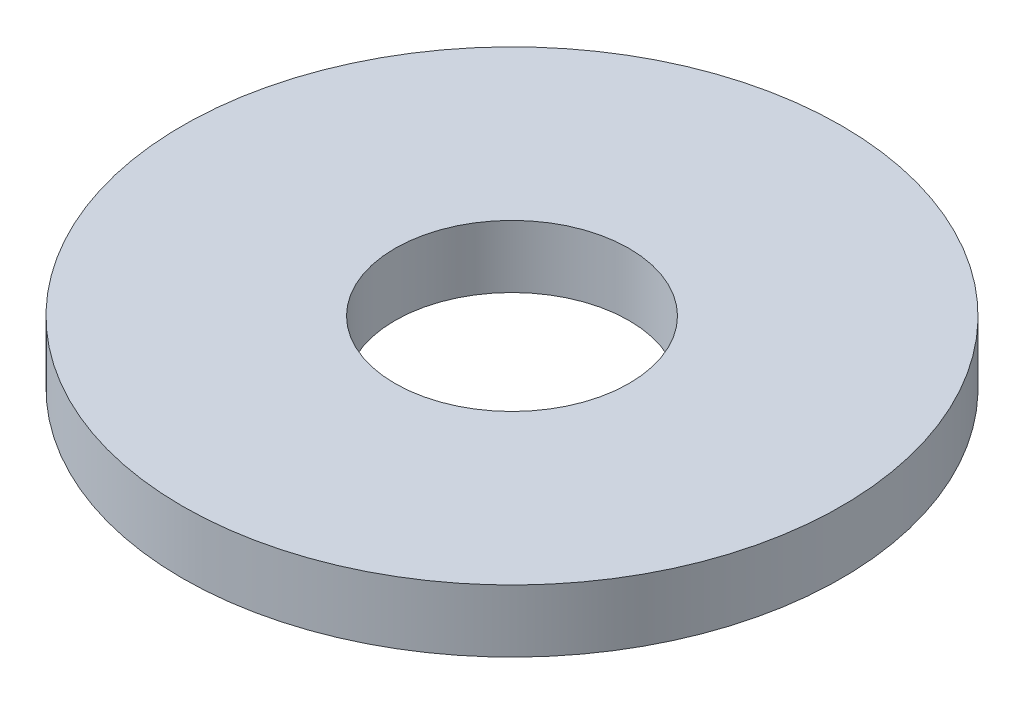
from build123d import *

# Parameters (mm, degrees)
SKETCH1_R      = 9.5123
SKETCH1_R_2    = 3.3782
EXTRUDE1_DEPTH = 1.8034


with BuildPart() as part:
    # Sketch1 → Extrude1 (new body)
    with BuildSketch(Plane(origin=(0, 0, 0), x_dir=(1, 0, 0), z_dir=(0, 1, 0))):
        with Locations(Location((0, 0, 0), (0, 0, 270))):
            Circle(SKETCH1_R)
        with Locations(Location((0, 0, 0), (0, 0, 270))):
            Circle(SKETCH1_R_2, mode=Mode.SUBTRACT)
    extrude(amount=EXTRUDE1_DEPTH)


solid = part.part
